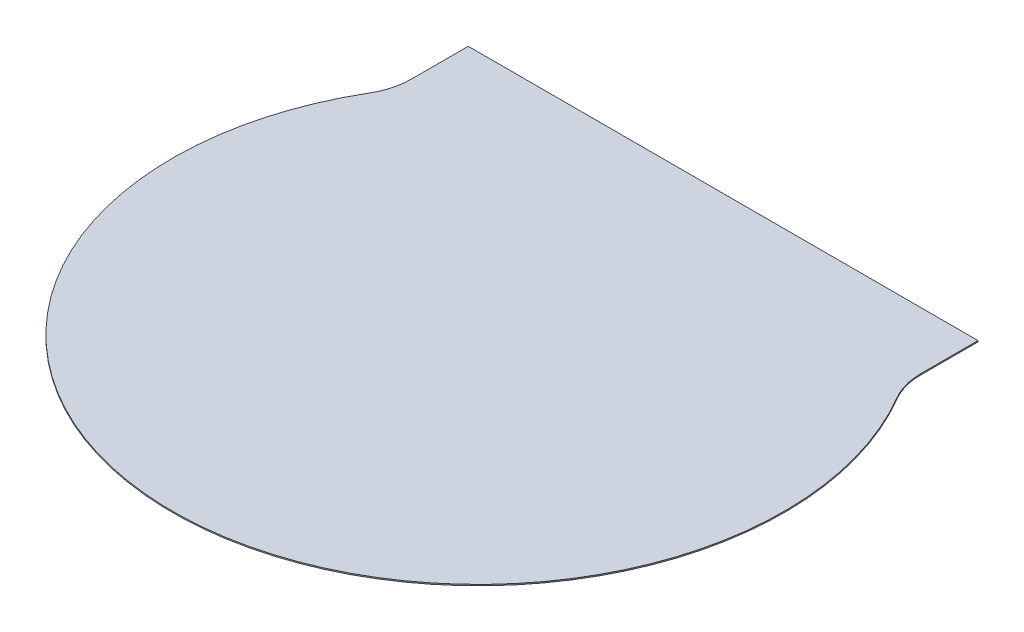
ISO-10303-21;
HEADER;
FILE_DESCRIPTION(('STEP AP214'),'2;1');
FILE_NAME('part.step','',(''),(''),'','','');
FILE_SCHEMA(('AUTOMOTIVE_DESIGN { 1 0 10303 214 1 1 1 1 }'));
ENDSEC;
DATA;
#1=APPLICATION_CONTEXT('core data for automotive mechanical design processes');
#2=APPLICATION_PROTOCOL_DEFINITION('international standard','automotive_design',2000,#1);
#3=PRODUCT_CONTEXT('',#1,'mechanical');
#4=PRODUCT('Part','Part','',(#3));
#5=PRODUCT_RELATED_PRODUCT_CATEGORY('part','',(#4));
#6=PRODUCT_DEFINITION_FORMATION('','',#4);
#7=PRODUCT_DEFINITION_CONTEXT('part definition',#1,'design');
#8=PRODUCT_DEFINITION('design','',#6,#7);
#9=PRODUCT_DEFINITION_SHAPE('','',#8);
#10=(LENGTH_UNIT() NAMED_UNIT(*) SI_UNIT(.MILLI.,.METRE.));
#11=(NAMED_UNIT(*) PLANE_ANGLE_UNIT() SI_UNIT($,.RADIAN.));
#12=(NAMED_UNIT(*) SI_UNIT($,.STERADIAN.) SOLID_ANGLE_UNIT());
#13=UNCERTAINTY_MEASURE_WITH_UNIT(LENGTH_MEASURE(1.E-05),#10,'distance_accuracy_value','');
#14=(GEOMETRIC_REPRESENTATION_CONTEXT(3) GLOBAL_UNCERTAINTY_ASSIGNED_CONTEXT((#13)) GLOBAL_UNIT_ASSIGNED_CONTEXT((#10,
#11,#12)) REPRESENTATION_CONTEXT('',''));
#15=CARTESIAN_POINT('',(0.,0.,0.));
#16=DIRECTION('',(0.,0.,1.));
#17=DIRECTION('',(1.,0.,0.));
#18=AXIS2_PLACEMENT_3D('',#15,#16,#17);
#19=CARTESIAN_POINT('',(3.98779999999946,0.015,-2.33831798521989));
#20=DIRECTION('',(0.,-1.,0.));
#21=DIRECTION('',(0.,0.,-1.));
#22=AXIS2_PLACEMENT_3D('',#19,#20,#21);
#23=CYLINDRICAL_SURFACE('',#22,0.812799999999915);
#24=CARTESIAN_POINT('',(3.98779999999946,0.,-2.33831798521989));
#25=DIRECTION('',(0.,1.,0.));
#26=DIRECTION('',(0.,0.,1.));
#27=AXIS2_PLACEMENT_3D('',#24,#25,#26);
#28=CIRCLE('',#27,0.812799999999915);
#29=CARTESIAN_POINT('',(3.17499999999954,0.,-2.33831798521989));
#30=VERTEX_POINT('',#29);
#31=CARTESIAN_POINT('',(3.28664835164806,0.,-1.9271851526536));
#32=VERTEX_POINT('',#31);
#33=EDGE_CURVE('E111',#30,#32,#28,.T.);
#34=ORIENTED_EDGE('',*,*,#33,.F.);
#35=DIRECTION('',(0.,-1.,0.));
#36=VECTOR('',#35,1.);
#37=CARTESIAN_POINT('',(3.17499999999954,0.015,-2.33831798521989));
#38=LINE('',#37,#36);
#39=CARTESIAN_POINT('',(3.17499999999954,0.015,-2.33831798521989));
#40=VERTEX_POINT('',#39);
#41=EDGE_CURVE('E11',#40,#30,#38,.T.);
#42=ORIENTED_EDGE('',*,*,#41,.F.);
#43=CARTESIAN_POINT('',(3.98779999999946,0.015,-2.33831798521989));
#44=DIRECTION('',(0.,1.,0.));
#45=DIRECTION('',(0.,0.,1.));
#46=AXIS2_PLACEMENT_3D('',#43,#44,#45);
#47=CIRCLE('',#46,0.812799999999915);
#48=CARTESIAN_POINT('',(3.28664835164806,0.015,-1.9271851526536));
#49=VERTEX_POINT('',#48);
#50=EDGE_CURVE('E124',#40,#49,#47,.T.);
#51=ORIENTED_EDGE('',*,*,#50,.T.);
#52=DIRECTION('',(0.,-1.,0.));
#53=VECTOR('',#52,1.);
#54=CARTESIAN_POINT('',(3.28664835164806,0.015,-1.9271851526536));
#55=LINE('',#54,#53);
#56=EDGE_CURVE('E74',#49,#32,#55,.T.);
#57=ORIENTED_EDGE('',*,*,#56,.T.);
#58=EDGE_LOOP('',(#34,#42,#51,#57));
#59=FACE_BOUND('',#58,.T.);
#60=ADVANCED_FACE('F30',(#59),#23,.F.);
#61=CARTESIAN_POINT('',(3.17499999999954,0.015,0.380999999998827));
#62=DIRECTION('',(-1.,0.,0.));
#63=DIRECTION('',(0.,0.,1.));
#64=AXIS2_PLACEMENT_3D('',#61,#62,#63);
#65=PLANE('',#64);
#66=DIRECTION('',(0.,0.,-1.));
#67=VECTOR('',#66,1.);
#68=CARTESIAN_POINT('',(3.17499999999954,0.,0.380999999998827));
#69=LINE('',#68,#67);
#70=CARTESIAN_POINT('',(3.17499999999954,0.,-3.04800000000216));
#71=VERTEX_POINT('',#70);
#72=EDGE_CURVE('E114',#30,#71,#69,.T.);
#73=ORIENTED_EDGE('',*,*,#72,.T.);
#74=DIRECTION('',(0.,-1.,0.));
#75=VECTOR('',#74,1.);
#76=CARTESIAN_POINT('',(3.17499999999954,0.015,-3.04800000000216));
#77=LINE('',#76,#75);
#78=CARTESIAN_POINT('',(3.17499999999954,0.015,-3.04800000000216));
#79=VERTEX_POINT('',#78);
#80=EDGE_CURVE('E38',#79,#71,#77,.T.);
#81=ORIENTED_EDGE('',*,*,#80,.F.);
#82=DIRECTION('',(0.,0.,-1.));
#83=VECTOR('',#82,1.);
#84=CARTESIAN_POINT('',(3.17499999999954,0.015,0.380999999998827));
#85=LINE('',#84,#83);
#86=EDGE_CURVE('E137',#40,#79,#85,.T.);
#87=ORIENTED_EDGE('',*,*,#86,.F.);
#88=ORIENTED_EDGE('',*,*,#41,.T.);
#89=EDGE_LOOP('',(#73,#81,#87,#88));
#90=FACE_BOUND('',#89,.T.);
#91=ADVANCED_FACE('F140',(#90),#65,.F.);
#92=CARTESIAN_POINT('',(-8.1153426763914,0.015,-3.04800000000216));
#93=DIRECTION('',(0.,0.,1.));
#94=DIRECTION('',(1.,0.,0.));
#95=AXIS2_PLACEMENT_3D('',#92,#93,#94);
#96=PLANE('',#95);
#97=DIRECTION('',(-1.,0.,0.));
#98=VECTOR('',#97,1.);
#99=CARTESIAN_POINT('',(-8.1153426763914,0.,-3.04800000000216));
#100=LINE('',#99,#98);
#101=CARTESIAN_POINT('',(-3.17499999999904,0.,-3.04800000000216));
#102=VERTEX_POINT('',#101);
#103=EDGE_CURVE('E116',#71,#102,#100,.T.);
#104=ORIENTED_EDGE('',*,*,#103,.T.);
#105=DIRECTION('',(0.,-1.,0.));
#106=VECTOR('',#105,1.);
#107=CARTESIAN_POINT('',(-3.17499999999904,0.015,-3.04800000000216));
#108=LINE('',#107,#106);
#109=CARTESIAN_POINT('',(-3.17499999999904,0.015,-3.04800000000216));
#110=VERTEX_POINT('',#109);
#111=EDGE_CURVE('E98',#110,#102,#108,.T.);
#112=ORIENTED_EDGE('',*,*,#111,.F.);
#113=DIRECTION('',(-1.,0.,0.));
#114=VECTOR('',#113,1.);
#115=CARTESIAN_POINT('',(-8.1153426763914,0.015,-3.04800000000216));
#116=LINE('',#115,#114);
#117=EDGE_CURVE('E103',#79,#110,#116,.T.);
#118=ORIENTED_EDGE('',*,*,#117,.F.);
#119=ORIENTED_EDGE('',*,*,#80,.T.);
#120=EDGE_LOOP('',(#104,#112,#118,#119));
#121=FACE_BOUND('',#120,.T.);
#122=ADVANCED_FACE('F131',(#121),#96,.F.);
#123=CARTESIAN_POINT('',(-3.17499999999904,0.015,0.380999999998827));
#124=DIRECTION('',(-1.,0.,0.));
#125=DIRECTION('',(0.,0.,1.));
#126=AXIS2_PLACEMENT_3D('',#123,#124,#125);
#127=PLANE('',#126);
#128=DIRECTION('',(0.,0.,-1.));
#129=VECTOR('',#128,1.);
#130=CARTESIAN_POINT('',(-3.17499999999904,0.,0.380999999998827));
#131=LINE('',#130,#129);
#132=CARTESIAN_POINT('',(-3.17499999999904,0.,-2.33831798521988));
#133=VERTEX_POINT('',#132);
#134=EDGE_CURVE('E93',#133,#102,#131,.T.);
#135=ORIENTED_EDGE('',*,*,#134,.F.);
#136=DIRECTION('',(0.,-1.,0.));
#137=VECTOR('',#136,1.);
#138=CARTESIAN_POINT('',(-3.17499999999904,0.015,-2.33831798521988));
#139=LINE('',#138,#137);
#140=CARTESIAN_POINT('',(-3.17499999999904,0.015,-2.33831798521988));
#141=VERTEX_POINT('',#140);
#142=EDGE_CURVE('E88',#141,#133,#139,.T.);
#143=ORIENTED_EDGE('',*,*,#142,.F.);
#144=DIRECTION('',(0.,0.,-1.));
#145=VECTOR('',#144,1.);
#146=CARTESIAN_POINT('',(-3.17499999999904,0.015,0.380999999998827));
#147=LINE('',#146,#145);
#148=EDGE_CURVE('E91',#141,#110,#147,.T.);
#149=ORIENTED_EDGE('',*,*,#148,.T.);
#150=ORIENTED_EDGE('',*,*,#111,.T.);
#151=EDGE_LOOP('',(#135,#143,#149,#150));
#152=FACE_BOUND('',#151,.T.);
#153=ADVANCED_FACE('F90',(#152),#127,.T.);
#154=CARTESIAN_POINT('',(-3.98779999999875,0.015,-2.33831798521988));
#155=DIRECTION('',(0.,-1.,0.));
#156=DIRECTION('',(0.,0.,-1.));
#157=AXIS2_PLACEMENT_3D('',#154,#155,#156);
#158=CYLINDRICAL_SURFACE('',#157,0.812799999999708);
#159=CARTESIAN_POINT('',(-3.98779999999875,0.,-2.33831798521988));
#160=DIRECTION('',(0.,1.,0.));
#161=DIRECTION('',(0.,0.,1.));
#162=AXIS2_PLACEMENT_3D('',#159,#160,#161);
#163=CIRCLE('',#162,0.812799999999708);
#164=CARTESIAN_POINT('',(-3.28664835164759,0.,-1.9271851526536));
#165=VERTEX_POINT('',#164);
#166=EDGE_CURVE('E120',#165,#133,#163,.T.);
#167=ORIENTED_EDGE('',*,*,#166,.F.);
#168=DIRECTION('',(0.,-1.,0.));
#169=VECTOR('',#168,1.);
#170=CARTESIAN_POINT('',(-3.28664835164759,0.015,-1.9271851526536));
#171=LINE('',#170,#169);
#172=CARTESIAN_POINT('',(-3.28664835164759,0.015,-1.9271851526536));
#173=VERTEX_POINT('',#172);
#174=EDGE_CURVE('E67',#173,#165,#171,.T.);
#175=ORIENTED_EDGE('',*,*,#174,.F.);
#176=CARTESIAN_POINT('',(-3.98779999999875,0.015,-2.33831798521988));
#177=DIRECTION('',(0.,1.,0.));
#178=DIRECTION('',(0.,0.,1.));
#179=AXIS2_PLACEMENT_3D('',#176,#177,#178);
#180=CIRCLE('',#179,0.812799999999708);
#181=EDGE_CURVE('E101',#173,#141,#180,.T.);
#182=ORIENTED_EDGE('',*,*,#181,.T.);
#183=ORIENTED_EDGE('',*,*,#142,.T.);
#184=EDGE_LOOP('',(#167,#175,#182,#183));
#185=FACE_BOUND('',#184,.T.);
#186=ADVANCED_FACE('F106',(#185),#158,.F.);
#187=CARTESIAN_POINT('',(2.37223435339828E-13,0.015,0.));
#188=DIRECTION('',(0.,-1.,0.));
#189=DIRECTION('',(0.,0.,-1.));
#190=AXIS2_PLACEMENT_3D('',#187,#188,#189);
#191=CYLINDRICAL_SURFACE('',#190,3.80999999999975);
#192=CARTESIAN_POINT('',(2.37223435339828E-13,0.,0.));
#193=DIRECTION('',(0.,1.,0.));
#194=DIRECTION('',(0.,0.,1.));
#195=AXIS2_PLACEMENT_3D('',#192,#193,#194);
#196=CIRCLE('',#195,3.80999999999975);
#197=EDGE_CURVE('E122',#165,#32,#196,.T.);
#198=ORIENTED_EDGE('',*,*,#197,.T.);
#199=ORIENTED_EDGE('',*,*,#56,.F.);
#200=CARTESIAN_POINT('',(2.37223435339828E-13,0.015,0.));
#201=DIRECTION('',(0.,1.,0.));
#202=DIRECTION('',(0.,0.,1.));
#203=AXIS2_PLACEMENT_3D('',#200,#201,#202);
#204=CIRCLE('',#203,3.80999999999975);
#205=EDGE_CURVE('E46',#173,#49,#204,.T.);
#206=ORIENTED_EDGE('',*,*,#205,.F.);
#207=ORIENTED_EDGE('',*,*,#174,.T.);
#208=EDGE_LOOP('',(#198,#199,#206,#207));
#209=FACE_BOUND('',#208,.T.);
#210=ADVANCED_FACE('F136',(#209),#191,.T.);
#211=CARTESIAN_POINT('',(-8.1153426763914,0.015,0.380999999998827));
#212=DIRECTION('',(0.,1.,0.));
#213=DIRECTION('',(0.,0.,1.));
#214=AXIS2_PLACEMENT_3D('',#211,#212,#213);
#215=PLANE('',#214);
#216=ORIENTED_EDGE('',*,*,#50,.F.);
#217=ORIENTED_EDGE('',*,*,#86,.T.);
#218=ORIENTED_EDGE('',*,*,#117,.T.);
#219=ORIENTED_EDGE('',*,*,#148,.F.);
#220=ORIENTED_EDGE('',*,*,#181,.F.);
#221=ORIENTED_EDGE('',*,*,#205,.T.);
#222=EDGE_LOOP('',(#216,#217,#218,#219,#220,#221));
#223=FACE_BOUND('',#222,.T.);
#224=ADVANCED_FACE('F100',(#223),#215,.T.);
#225=CARTESIAN_POINT('',(-8.1153426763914,0.,0.380999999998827));
#226=DIRECTION('',(0.,1.,0.));
#227=DIRECTION('',(0.,0.,1.));
#228=AXIS2_PLACEMENT_3D('',#225,#226,#227);
#229=PLANE('',#228);
#230=ORIENTED_EDGE('',*,*,#33,.T.);
#231=ORIENTED_EDGE('',*,*,#197,.F.);
#232=ORIENTED_EDGE('',*,*,#166,.T.);
#233=ORIENTED_EDGE('',*,*,#134,.T.);
#234=ORIENTED_EDGE('',*,*,#103,.F.);
#235=ORIENTED_EDGE('',*,*,#72,.F.);
#236=EDGE_LOOP('',(#230,#231,#232,#233,#234,#235));
#237=FACE_BOUND('',#236,.T.);
#238=ADVANCED_FACE('F135',(#237),#229,.F.);
#239=CLOSED_SHELL('',(#60,#91,#122,#153,#186,#210,#224,#238));
#240=MANIFOLD_SOLID_BREP('B2',#239);
#241=ADVANCED_BREP_SHAPE_REPRESENTATION('',(#18,#240),#14);
#242=SHAPE_DEFINITION_REPRESENTATION(#9,#241);
ENDSEC;
END-ISO-10303-21;
